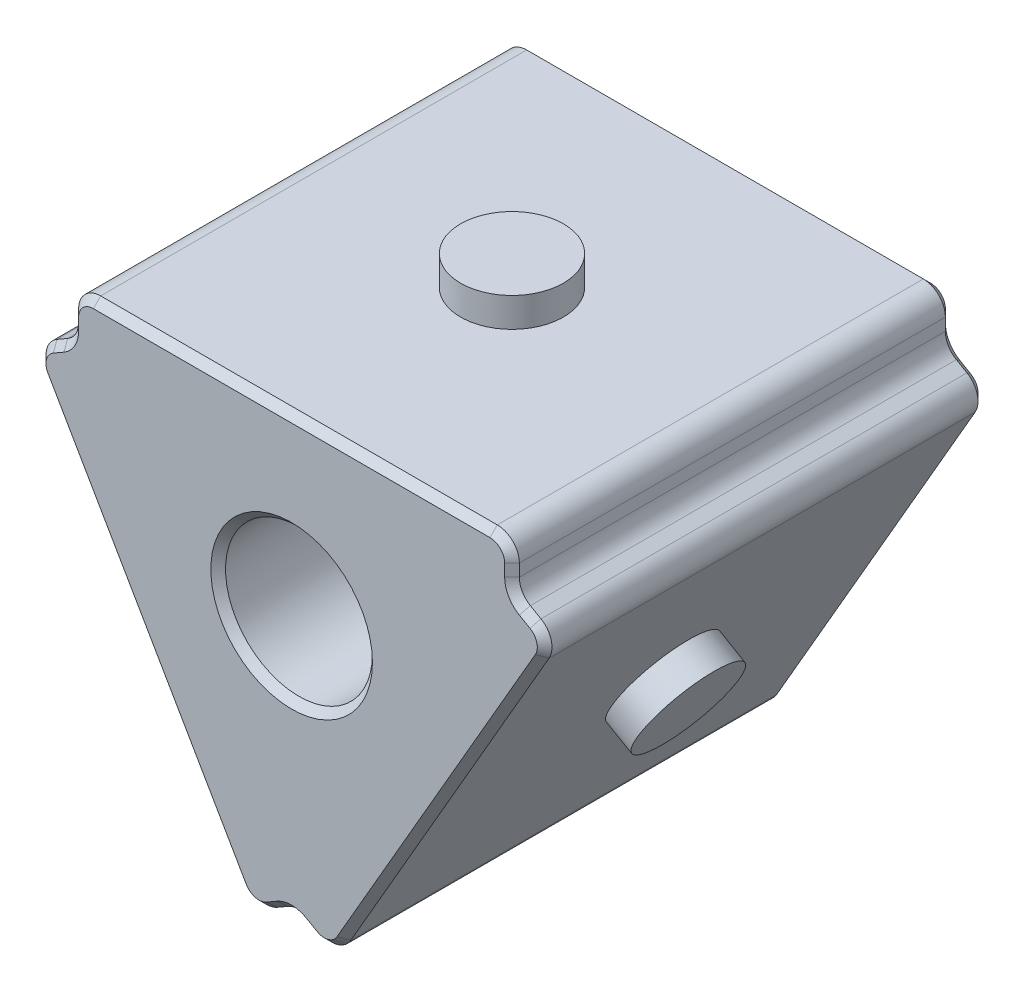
from build123d import *

# Parameters (mm, degrees)
SZKIC2_R                    = 5
DODANIE_WYCI_GNI_CIE1_DEPTH = 30
ZAOKR_GLENIE1_R             = 1.5
SFAZOWANIE1_SIZE            = 0.5
SZKIC3_R                    = 3.5
DODANIE_WYCI_GNI_CIE2_DEPTH = 2
SZYK_KO_OWY1_COUNT          = 3


with BuildPart() as part:
    # Szkic2 → Dodanie-wyci_gni_cie1 (new body)
    with BuildSketch(Plane.XY):
        Polygon((-16.99838705, 43.916845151), (-14.22720687, 45.516786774), (-14.22720687, 48.716670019), (15.77279313, 48.716670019), (15.77279313, 45.516786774), (18.54397331, 43.916845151), (3.54397331, 17.936083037), (0.77279313, 19.53602466), (-1.99838705, 17.936083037), align=None)
        with Locations((0.77279313, 36.856532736)):
            Circle(SZKIC2_R, mode=Mode.SUBTRACT)
    extrude(amount=DODANIE_WYCI_GNI_CIE1_DEPTH)

    # Zaokr_glenie1
    zaokr_glenie1_edges = [part.edges().sort_by_distance(p)[0] for p in [
        (-14.22720687, 48.716670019, 15),
        (15.77279313, 48.716670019, 15),
        (15.77279313, 45.516786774, 15),
        (18.54397331, 43.916845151, 15),
        (3.54397331, 17.936083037, 15),
        (0.77279313, 19.53602466, 15),
        (-1.99838705, 17.936083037, 15),
        (-16.99838705, 43.916845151, 15),
        (-14.22720687, 45.516786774, 15),
    ]]
    fillet(zaokr_glenie1_edges, radius=ZAOKR_GLENIE1_R)

    # Sfazowanie1
    sfazowanie1_edges = [part.edges().sort_by_distance(p)[0] for p in [
        (-4.22720687, 36.856532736, 0),
        (-4.22720687, 36.856532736, 30),
        (15.77279313, 46.799741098, 0),
        (15.77279313, 46.799741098, 30),
        (16.883864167, 44.875309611, 0),
        (16.883864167, 44.875309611, 30),
        (1.883864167, 18.894547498, 0),
        (1.883864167, 18.894547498, 30),
        (-0.338277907, 18.894547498, 0),
        (-0.338277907, 18.894547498, 30),
        (-15.338277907, 44.875309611, 0),
        (-15.338277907, 44.875309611, 30),
        (-14.22720687, 46.799741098, 0),
        (-14.22720687, 46.799741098, 30),
        (0.77279313, 48.716670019, 0),
        (11.04397331, 30.926464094, 0),
        (-9.49838705, 30.926464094, 0),
        (15.333453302, 48.277330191, 0),
        (17.943823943, 43.756035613, 0),
        (3.383163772, 18.536232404, 0),
        (-1.837577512, 18.536232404, 0),
        (-16.398237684, 43.756035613, 0),
        (-13.787867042, 48.277330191, 0),
        (0.77279313, 48.716670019, 30),
        (-9.49838705, 30.926464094, 30),
        (11.04397331, 30.926464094, 30),
        (15.333453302, 48.277330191, 30),
        (17.943823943, 43.756035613, 30),
        (3.383163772, 18.536232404, 30),
        (-1.837577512, 18.536232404, 30),
        (-16.398237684, 43.756035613, 30),
        (-13.787867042, 48.277330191, 30),
        (15.973755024, 45.632812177, 0),
        (15.973755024, 45.632812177, 30),
        (0.77279313, 19.303973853, 0),
        (0.77279313, 19.303973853, 30),
        (-14.428168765, 45.632812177, 0),
        (-14.428168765, 45.632812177, 30),
    ]]
    chamfer(sfazowanie1_edges, length=SFAZOWANIE1_SIZE)

    # Szkic3 → Dodanie-wyci_gni_cie2 (add)
    with BuildSketch(Plane(origin=(0, 48.716670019, 0), x_dir=(1, 0, 0), z_dir=(0, 1, 0))):
        with Locations(Location((0.77279313, -15, 0), (0, 0, 90))):
            Circle(SZKIC3_R)
    dodanie_wyci_gni_cie2 = extrude(amount=DODANIE_WYCI_GNI_CIE2_DEPTH)

    # Szyk ko_owy1: Dodanie-wyci_gni_cie2 ×3 about axis
    szyk_ko_owy1_axis = Axis((0.77279313, 36.856532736, 0), (0, 0, 1))
    for i in range(1, SZYK_KO_OWY1_COUNT):
        add(dodanie_wyci_gni_cie2.rotate(szyk_ko_owy1_axis, i * 360 / SZYK_KO_OWY1_COUNT))


solid = part.part
